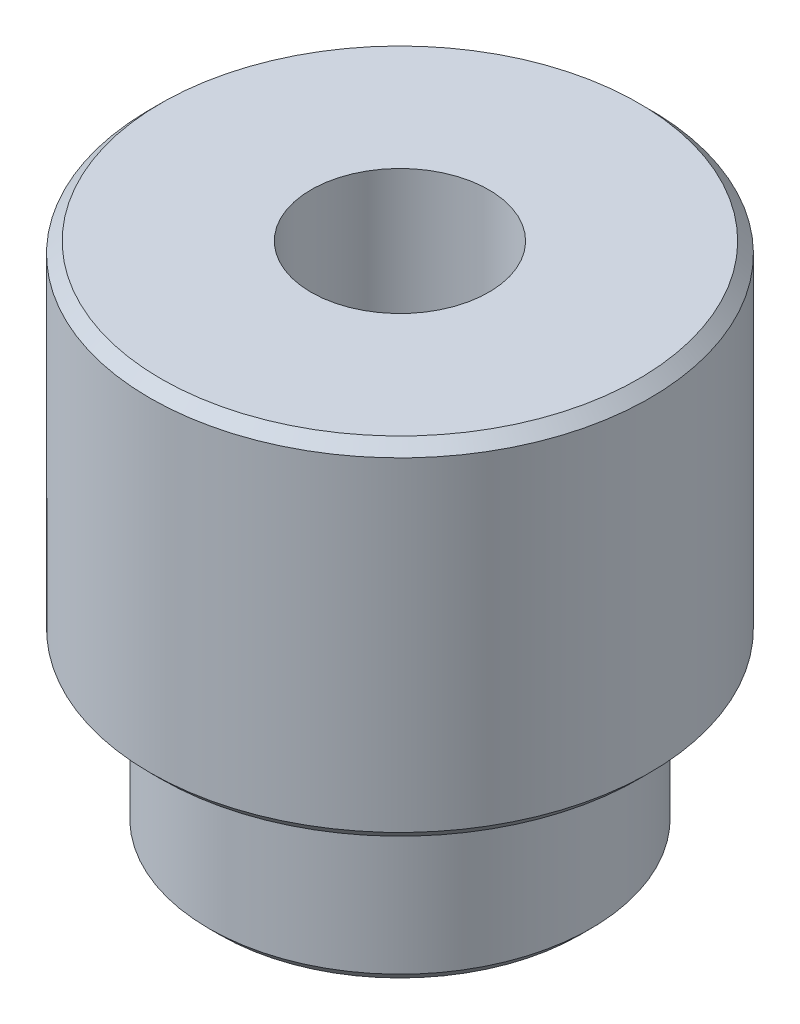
from build123d import *

# Parameters (mm, degrees)
SKETCH1_R               = 2.25
BOSS_EXTRUDE1_DEPTH     = 3.12
SKETCH2_R               = 1.72
BOSS_EXTRUDE2_DEPTH     = 1.48
TAP_DRILL_FOR_M2_TAP1_D = 1.6
CHAMFER1_SIZE           = 0.1


with BuildPart() as part:
    # Sketch1 → Boss-Extrude1 (new body)
    with BuildSketch(Plane(origin=(0, 0, 0), x_dir=(1, 0, 0), z_dir=(0, 1, 0))):
        with Locations(Location((0, 0, 0), (0, 0, 270))):
            Circle(SKETCH1_R)
    extrude(amount=-BOSS_EXTRUDE1_DEPTH)

    # Sketch2 → Boss-Extrude2 (add)
    with BuildSketch(Plane.XZ.offset(3.12)):
        with Locations(Location((0, 0, 0), (0, 0, 270))):
            Circle(SKETCH2_R)
    extrude(amount=BOSS_EXTRUDE2_DEPTH)

    # Tap Drill for M2 Tap1 (through all)
    with Locations(Plane(origin=(0, 0, 0), x_dir=(1, 0, 0), z_dir=(0, 1, 0))):
        with Locations((0, 0)):
            Hole(TAP_DRILL_FOR_M2_TAP1_D / 2)

    # Chamfer1
    chamfer1_edges = [part.edges().sort_by_distance(p)[0] for p in [
        (0, 0, -2.25),
        (0, -3.12, -2.25),
        (0, -4.6, 1.72),
    ]]
    chamfer(chamfer1_edges, length=CHAMFER1_SIZE)


solid = part.part
